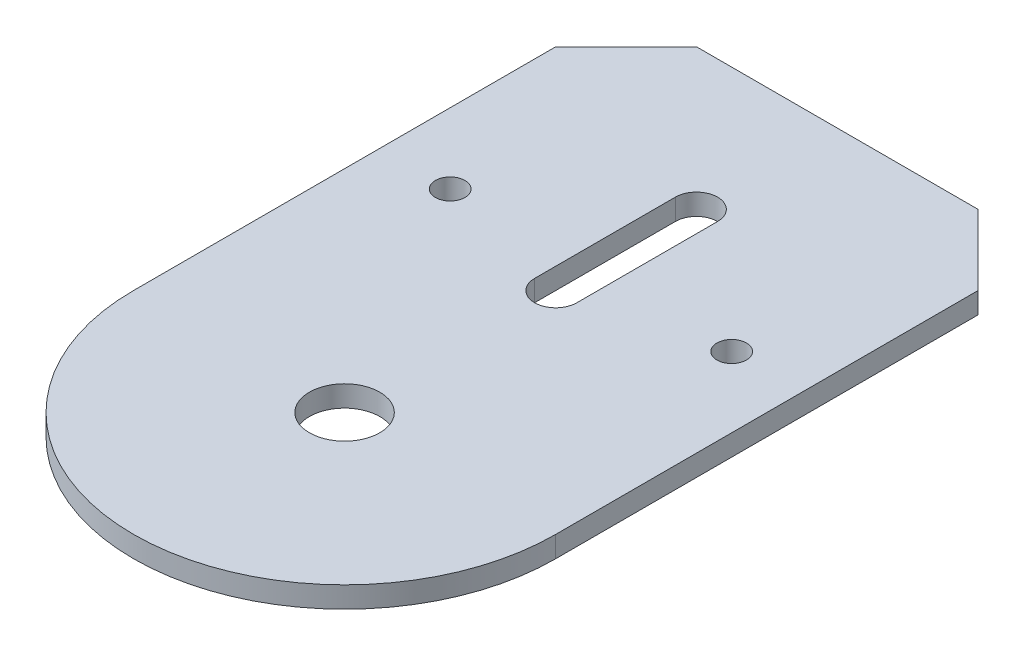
from build123d import *

# Parameters (mm, degrees)
SKETCH1_R         = 5
EXTRUDE1_DEPTH    = 3
M5_TAPPED_HOLE1_D = 4.2


with BuildPart() as part:
    # Sketch1 → Extrude1 (new body)
    with BuildSketch(Plane(origin=(0, 0, 0), x_dir=(1, 0, 0), z_dir=(0, 1, 0))):
        with BuildLine():
            Line((-30, 0), (-30, 60))
            Line((-30, 60), (-20, 70))
            Line((-20, 70), (20, 70))
            Line((20, 70), (30, 60))
            Line((30, 60), (30, 0))
            ThreePointArc((30, 0), (0, -30), (-30, 0))
        make_face()
        with Locations(Location((0, 0, 0), (0, 0, 270))):
            Circle(SKETCH1_R, mode=Mode.SUBTRACT)
        with BuildLine():
            Line((3, 30), (3, 50))
            ThreePointArc((3, 50), (0, 53), (-3, 50))
            Line((-3, 50), (-3, 30))
            ThreePointArc((-3, 30), (0, 27), (3, 30))
        make_face(mode=Mode.SUBTRACT)
    extrude(amount=EXTRUDE1_DEPTH)

    # M5 Tapped Hole1 (through all)
    with Locations(Plane(origin=(-20, 3, -35), x_dir=(0, 0, 1), z_dir=(0, 1, 0))):
        with Locations((0, 0), (0, 40)):
            Hole(M5_TAPPED_HOLE1_D / 2)


solid = part.part
